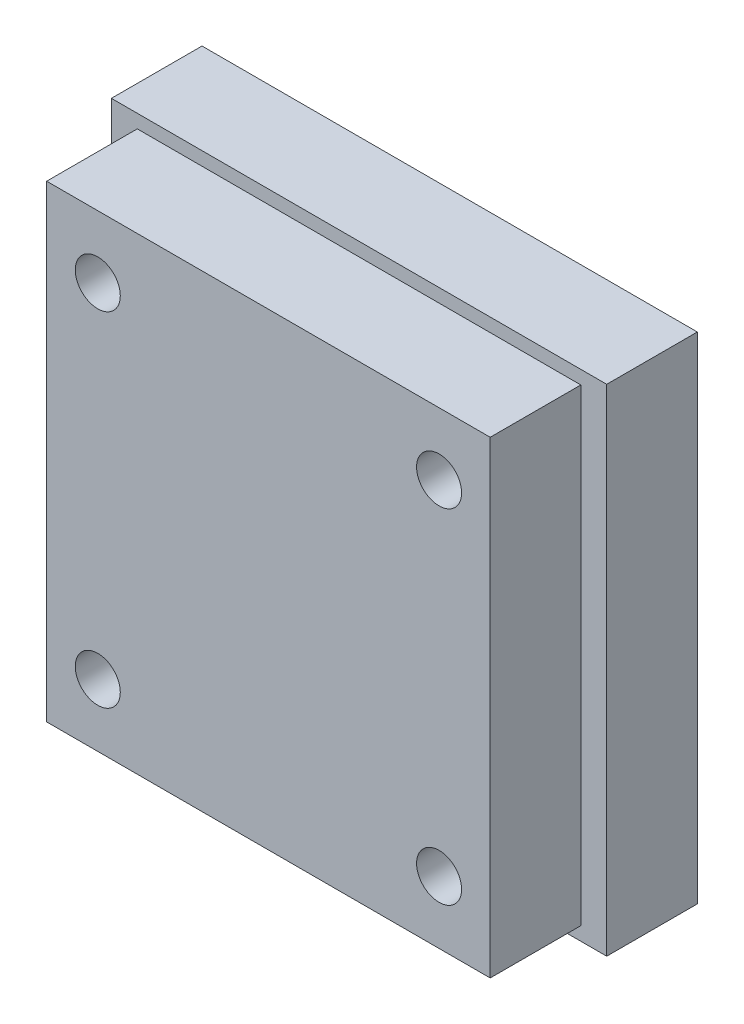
from build123d import *

# Parameters (mm, degrees)
SKETCH1_W           = 44
SKETCH1_H           = 44
BOSS_EXTRUDE1_DEPTH = 8.05
SKETCH2_W           = 39.4
SKETCH2_H           = 41.6
BOSS_EXTRUDE2_DEPTH = 8.05
SKETCH3_R           = 2
CUT_EXTRUDE1_DEPTH  = 36.031557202


with BuildPart() as part:
    # Sketch1 → Boss-Extrude1 (new body)
    with BuildSketch(Plane.XY):
        Rectangle(SKETCH1_W, SKETCH1_H)
    extrude(amount=BOSS_EXTRUDE1_DEPTH)

    # Sketch2 → Boss-Extrude2 (add)
    with BuildSketch(Plane.XY.offset(8.05)):
        Rectangle(SKETCH2_W, SKETCH2_H)
    extrude(amount=BOSS_EXTRUDE2_DEPTH)

    # Sketch3 → Cut-Extrude1 (cut, through all)
    with BuildSketch(Plane.XY.offset(16.1)):
        with Locations((-15.16, 15.25)):
            Circle(SKETCH3_R)
        with Locations((15.16, 15.25)):
            Circle(SKETCH3_R)
        with Locations((15.16, -15.25)):
            Circle(SKETCH3_R)
        with Locations((-15.16, -15.25)):
            Circle(SKETCH3_R)
    extrude(amount=-CUT_EXTRUDE1_DEPTH, mode=Mode.SUBTRACT)


solid = part.part
